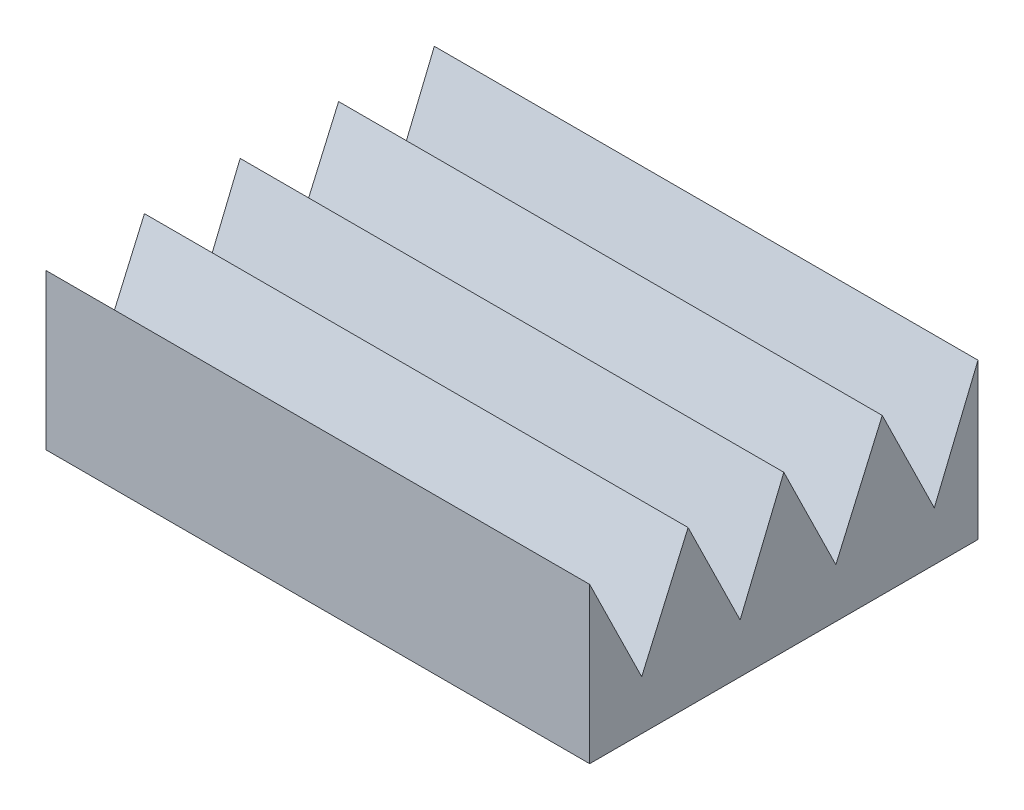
ISO-10303-21;
HEADER;
FILE_DESCRIPTION(('STEP AP214'),'2;1');
FILE_NAME('part.step','',(''),(''),'','','');
FILE_SCHEMA(('AUTOMOTIVE_DESIGN { 1 0 10303 214 1 1 1 1 }'));
ENDSEC;
DATA;
#1=APPLICATION_CONTEXT('core data for automotive mechanical design processes');
#2=APPLICATION_PROTOCOL_DEFINITION('international standard','automotive_design',2000,#1);
#3=PRODUCT_CONTEXT('',#1,'mechanical');
#4=PRODUCT('Part','Part','',(#3));
#5=PRODUCT_RELATED_PRODUCT_CATEGORY('part','',(#4));
#6=PRODUCT_DEFINITION_FORMATION('','',#4);
#7=PRODUCT_DEFINITION_CONTEXT('part definition',#1,'design');
#8=PRODUCT_DEFINITION('design','',#6,#7);
#9=PRODUCT_DEFINITION_SHAPE('','',#8);
#10=(LENGTH_UNIT() NAMED_UNIT(*) SI_UNIT(.MILLI.,.METRE.));
#11=(NAMED_UNIT(*) PLANE_ANGLE_UNIT() SI_UNIT($,.RADIAN.));
#12=(NAMED_UNIT(*) SI_UNIT($,.STERADIAN.) SOLID_ANGLE_UNIT());
#13=UNCERTAINTY_MEASURE_WITH_UNIT(LENGTH_MEASURE(1.E-05),#10,'distance_accuracy_value','');
#14=(GEOMETRIC_REPRESENTATION_CONTEXT(3) GLOBAL_UNCERTAINTY_ASSIGNED_CONTEXT((#13)) GLOBAL_UNIT_ASSIGNED_CONTEXT((#10,
#11,#12)) REPRESENTATION_CONTEXT('',''));
#15=CARTESIAN_POINT('',(0.,0.,0.));
#16=DIRECTION('',(0.,0.,1.));
#17=DIRECTION('',(1.,0.,0.));
#18=AXIS2_PLACEMENT_3D('',#15,#16,#17);
#19=CARTESIAN_POINT('',(0.,20.,0.));
#20=DIRECTION('',(1.,0.,0.));
#21=DIRECTION('',(0.,0.,-1.));
#22=AXIS2_PLACEMENT_3D('',#19,#20,#21);
#23=PLANE('',#22);
#24=DIRECTION('',(0.,0.916108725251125,-0.400929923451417));
#25=VECTOR('',#24,1.);
#26=CARTESIAN_POINT('',(0.,7.74201591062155,17.6901945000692));
#27=LINE('',#26,#25);
#28=CARTESIAN_POINT('',(0.,6.34501926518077,18.3015823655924));
#29=VERTEX_POINT('',#28);
#30=CARTESIAN_POINT('',(0.,20.,12.3255554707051));
#31=VERTEX_POINT('',#30);
#32=EDGE_CURVE('E157',#29,#31,#27,.T.);
#33=ORIENTED_EDGE('',*,*,#32,.T.);
#34=DIRECTION('',(0.,-0.897795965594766,-0.440411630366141));
#35=VECTOR('',#34,1.);
#36=CARTESIAN_POINT('',(0.,-0.994273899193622,2.02686540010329));
#37=LINE('',#36,#35);
#38=CARTESIAN_POINT('',(0.,6.34501926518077,5.6271378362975));
#39=VERTEX_POINT('',#38);
#40=EDGE_CURVE('E139',#31,#39,#37,.T.);
#41=ORIENTED_EDGE('',*,*,#40,.T.);
#42=DIRECTION('',(0.,0.924570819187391,-0.381010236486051));
#43=VECTOR('',#42,1.);
#44=CARTESIAN_POINT('',(0.,2.90337600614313,7.0454189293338));
#45=LINE('',#44,#43);
#46=CARTESIAN_POINT('',(0.,20.,0.));
#47=VERTEX_POINT('',#46);
#48=EDGE_CURVE('E146',#39,#47,#45,.T.);
#49=ORIENTED_EDGE('',*,*,#48,.T.);
#50=DIRECTION('',(0.,-1.,0.));
#51=VECTOR('',#50,1.);
#52=CARTESIAN_POINT('',(0.,20.,0.));
#53=LINE('',#52,#51);
#54=CARTESIAN_POINT('',(0.,0.,0.));
#55=VERTEX_POINT('',#54);
#56=EDGE_CURVE('E211',#47,#55,#53,.T.);
#57=ORIENTED_EDGE('',*,*,#56,.T.);
#58=DIRECTION('',(0.,0.,1.));
#59=VECTOR('',#58,1.);
#60=CARTESIAN_POINT('',(0.,0.,0.));
#61=LINE('',#60,#59);
#62=CARTESIAN_POINT('',(0.,0.,50.));
#63=VERTEX_POINT('',#62);
#64=EDGE_CURVE('E206',#55,#63,#61,.T.);
#65=ORIENTED_EDGE('',*,*,#64,.T.);
#66=DIRECTION('',(0.,-1.,0.));
#67=VECTOR('',#66,1.);
#68=CARTESIAN_POINT('',(0.,20.,50.));
#69=LINE('',#68,#67);
#70=CARTESIAN_POINT('',(0.,20.,50.));
#71=VERTEX_POINT('',#70);
#72=EDGE_CURVE('E12',#71,#63,#69,.T.);
#73=ORIENTED_EDGE('',*,*,#72,.F.);
#74=DIRECTION('',(0.,-0.897795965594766,-0.440411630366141));
#75=VECTOR('',#74,1.);
#76=CARTESIAN_POINT('',(0.,-15.8907411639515,32.3938840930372));
#77=LINE('',#76,#75);
#78=CARTESIAN_POINT('',(0.,6.34501926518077,43.3015823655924));
#79=VERTEX_POINT('',#78);
#80=EDGE_CURVE('E192',#71,#79,#77,.T.);
#81=ORIENTED_EDGE('',*,*,#80,.T.);
#82=DIRECTION('',(0.,0.916108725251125,-0.400929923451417));
#83=VECTOR('',#82,1.);
#84=CARTESIAN_POINT('',(0.,16.9244009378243,38.6715744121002));
#85=LINE('',#84,#83);
#86=CARTESIAN_POINT('',(0.,20.,37.3255554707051));
#87=VERTEX_POINT('',#86);
#88=EDGE_CURVE('E195',#79,#87,#85,.T.);
#89=ORIENTED_EDGE('',*,*,#88,.T.);
#90=DIRECTION('',(0.,-0.897795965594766,-0.440411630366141));
#91=VECTOR('',#90,1.);
#92=CARTESIAN_POINT('',(0.,-10.879268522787,22.1778052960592));
#93=LINE('',#92,#91);
#94=CARTESIAN_POINT('',(0.,6.34501926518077,30.6271378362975));
#95=VERTEX_POINT('',#94);
#96=EDGE_CURVE('E174',#87,#95,#93,.T.);
#97=ORIENTED_EDGE('',*,*,#96,.T.);
#98=DIRECTION('',(0.,0.924570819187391,-0.381010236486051));
#99=VECTOR('',#98,1.);
#100=CARTESIAN_POINT('',(0.,11.7101496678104,28.4161989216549));
#101=LINE('',#100,#99);
#102=CARTESIAN_POINT('',(0.,20.,25.));
#103=VERTEX_POINT('',#102);
#104=EDGE_CURVE('E178',#95,#103,#101,.T.);
#105=ORIENTED_EDGE('',*,*,#104,.T.);
#106=DIRECTION('',(0.,-0.897795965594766,-0.440411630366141));
#107=VECTOR('',#106,1.);
#108=CARTESIAN_POINT('',(0.,-6.00574654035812,12.2429441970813));
#109=LINE('',#108,#107);
#110=EDGE_CURVE('E163',#103,#29,#109,.T.);
#111=ORIENTED_EDGE('',*,*,#110,.T.);
#112=EDGE_LOOP('',(#33,#41,#49,#57,#65,#73,#81,#89,#97,#105,#111));
#113=FACE_BOUND('',#112,.T.);
#114=ADVANCED_FACE('F51',(#113),#23,.F.);
#115=CARTESIAN_POINT('',(0.,20.,50.));
#116=DIRECTION('',(0.,0.,-1.));
#117=DIRECTION('',(-1.,0.,0.));
#118=AXIS2_PLACEMENT_3D('',#115,#116,#117);
#119=PLANE('',#118);
#120=DIRECTION('',(1.,0.,0.));
#121=VECTOR('',#120,1.);
#122=CARTESIAN_POINT('',(0.,0.,50.));
#123=LINE('',#122,#121);
#124=CARTESIAN_POINT('',(70.,0.,50.));
#125=VERTEX_POINT('',#124);
#126=EDGE_CURVE('E214',#63,#125,#123,.T.);
#127=ORIENTED_EDGE('',*,*,#126,.T.);
#128=DIRECTION('',(0.,-1.,0.));
#129=VECTOR('',#128,1.);
#130=CARTESIAN_POINT('',(70.,20.,50.));
#131=LINE('',#130,#129);
#132=CARTESIAN_POINT('',(70.,20.,50.));
#133=VERTEX_POINT('',#132);
#134=EDGE_CURVE('E58',#133,#125,#131,.T.);
#135=ORIENTED_EDGE('',*,*,#134,.F.);
#136=DIRECTION('',(1.,0.,0.));
#137=VECTOR('',#136,1.);
#138=CARTESIAN_POINT('',(0.,20.,50.));
#139=LINE('',#138,#137);
#140=EDGE_CURVE('E208',#71,#133,#139,.T.);
#141=ORIENTED_EDGE('',*,*,#140,.F.);
#142=ORIENTED_EDGE('',*,*,#72,.T.);
#143=EDGE_LOOP('',(#127,#135,#141,#142));
#144=FACE_BOUND('',#143,.T.);
#145=ADVANCED_FACE('F251',(#144),#119,.F.);
#146=CARTESIAN_POINT('',(70.,20.,0.));
#147=DIRECTION('',(-1.,0.,0.));
#148=DIRECTION('',(0.,0.,1.));
#149=AXIS2_PLACEMENT_3D('',#146,#147,#148);
#150=PLANE('',#149);
#151=DIRECTION('',(0.,0.924570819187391,-0.381010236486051));
#152=VECTOR('',#151,1.);
#153=CARTESIAN_POINT('',(70.,2.90337600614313,7.0454189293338));
#154=LINE('',#153,#152);
#155=CARTESIAN_POINT('',(70.,6.34501926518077,5.6271378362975));
#156=VERTEX_POINT('',#155);
#157=CARTESIAN_POINT('',(70.,20.,0.));
#158=VERTEX_POINT('',#157);
#159=EDGE_CURVE('E158',#156,#158,#154,.T.);
#160=ORIENTED_EDGE('',*,*,#159,.F.);
#161=DIRECTION('',(0.,-0.897795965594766,-0.440411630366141));
#162=VECTOR('',#161,1.);
#163=CARTESIAN_POINT('',(70.,-0.994273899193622,2.02686540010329));
#164=LINE('',#163,#162);
#165=CARTESIAN_POINT('',(70.,20.,12.3255554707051));
#166=VERTEX_POINT('',#165);
#167=EDGE_CURVE('E142',#166,#156,#164,.T.);
#168=ORIENTED_EDGE('',*,*,#167,.F.);
#169=DIRECTION('',(0.,0.916108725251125,-0.400929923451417));
#170=VECTOR('',#169,1.);
#171=CARTESIAN_POINT('',(70.,7.74201591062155,17.6901945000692));
#172=LINE('',#171,#170);
#173=CARTESIAN_POINT('',(70.,6.34501926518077,18.3015823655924));
#174=VERTEX_POINT('',#173);
#175=EDGE_CURVE('E165',#174,#166,#172,.T.);
#176=ORIENTED_EDGE('',*,*,#175,.F.);
#177=DIRECTION('',(0.,-0.897795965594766,-0.440411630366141));
#178=VECTOR('',#177,1.);
#179=CARTESIAN_POINT('',(70.,-6.00574654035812,12.2429441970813));
#180=LINE('',#179,#178);
#181=CARTESIAN_POINT('',(70.,20.,25.));
#182=VERTEX_POINT('',#181);
#183=EDGE_CURVE('E145',#182,#174,#180,.T.);
#184=ORIENTED_EDGE('',*,*,#183,.F.);
#185=DIRECTION('',(0.,0.924570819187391,-0.381010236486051));
#186=VECTOR('',#185,1.);
#187=CARTESIAN_POINT('',(70.,11.7101496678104,28.4161989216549));
#188=LINE('',#187,#186);
#189=CARTESIAN_POINT('',(70.,6.34501926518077,30.6271378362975));
#190=VERTEX_POINT('',#189);
#191=EDGE_CURVE('E182',#190,#182,#188,.T.);
#192=ORIENTED_EDGE('',*,*,#191,.F.);
#193=DIRECTION('',(0.,-0.897795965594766,-0.440411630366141));
#194=VECTOR('',#193,1.);
#195=CARTESIAN_POINT('',(70.,-10.879268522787,22.1778052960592));
#196=LINE('',#195,#194);
#197=CARTESIAN_POINT('',(70.,20.,37.3255554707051));
#198=VERTEX_POINT('',#197);
#199=EDGE_CURVE('E181',#198,#190,#196,.T.);
#200=ORIENTED_EDGE('',*,*,#199,.F.);
#201=DIRECTION('',(0.,0.916108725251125,-0.400929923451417));
#202=VECTOR('',#201,1.);
#203=CARTESIAN_POINT('',(70.,16.9244009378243,38.6715744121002));
#204=LINE('',#203,#202);
#205=CARTESIAN_POINT('',(70.,6.34501926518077,43.3015823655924));
#206=VERTEX_POINT('',#205);
#207=EDGE_CURVE('E196',#206,#198,#204,.T.);
#208=ORIENTED_EDGE('',*,*,#207,.F.);
#209=DIRECTION('',(0.,-0.897795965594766,-0.440411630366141));
#210=VECTOR('',#209,1.);
#211=CARTESIAN_POINT('',(70.,-15.8907411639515,32.3938840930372));
#212=LINE('',#211,#210);
#213=EDGE_CURVE('E185',#133,#206,#212,.T.);
#214=ORIENTED_EDGE('',*,*,#213,.F.);
#215=ORIENTED_EDGE('',*,*,#134,.T.);
#216=DIRECTION('',(0.,0.,-1.));
#217=VECTOR('',#216,1.);
#218=CARTESIAN_POINT('',(70.,0.,0.));
#219=LINE('',#218,#217);
#220=CARTESIAN_POINT('',(70.,0.,0.));
#221=VERTEX_POINT('',#220);
#222=EDGE_CURVE('E73',#125,#221,#219,.T.);
#223=ORIENTED_EDGE('',*,*,#222,.T.);
#224=DIRECTION('',(0.,-1.,0.));
#225=VECTOR('',#224,1.);
#226=CARTESIAN_POINT('',(70.,20.,0.));
#227=LINE('',#226,#225);
#228=EDGE_CURVE('E219',#158,#221,#227,.T.);
#229=ORIENTED_EDGE('',*,*,#228,.F.);
#230=EDGE_LOOP('',(#160,#168,#176,#184,#192,#200,#208,#214,#215,#223,#229));
#231=FACE_BOUND('',#230,.T.);
#232=ADVANCED_FACE('F222',(#231),#150,.F.);
#233=CARTESIAN_POINT('',(0.,20.,0.));
#234=DIRECTION('',(0.,0.,1.));
#235=DIRECTION('',(1.,0.,0.));
#236=AXIS2_PLACEMENT_3D('',#233,#234,#235);
#237=PLANE('',#236);
#238=DIRECTION('',(-1.,0.,0.));
#239=VECTOR('',#238,1.);
#240=CARTESIAN_POINT('',(0.,0.,0.));
#241=LINE('',#240,#239);
#242=EDGE_CURVE('E65',#221,#55,#241,.T.);
#243=ORIENTED_EDGE('',*,*,#242,.T.);
#244=ORIENTED_EDGE('',*,*,#56,.F.);
#245=DIRECTION('',(-1.,0.,0.));
#246=VECTOR('',#245,1.);
#247=CARTESIAN_POINT('',(0.,20.,0.));
#248=LINE('',#247,#246);
#249=EDGE_CURVE('E151',#158,#47,#248,.T.);
#250=ORIENTED_EDGE('',*,*,#249,.F.);
#251=ORIENTED_EDGE('',*,*,#228,.T.);
#252=EDGE_LOOP('',(#243,#244,#250,#251));
#253=FACE_BOUND('',#252,.T.);
#254=ADVANCED_FACE('F230',(#253),#237,.F.);
#255=CARTESIAN_POINT('',(0.,0.,0.));
#256=DIRECTION('',(0.,1.,0.));
#257=DIRECTION('',(0.,0.,1.));
#258=AXIS2_PLACEMENT_3D('',#255,#256,#257);
#259=PLANE('',#258);
#260=ORIENTED_EDGE('',*,*,#64,.F.);
#261=ORIENTED_EDGE('',*,*,#242,.F.);
#262=ORIENTED_EDGE('',*,*,#222,.F.);
#263=ORIENTED_EDGE('',*,*,#126,.F.);
#264=EDGE_LOOP('',(#260,#261,#262,#263));
#265=FACE_BOUND('',#264,.T.);
#266=ADVANCED_FACE('F228',(#265),#259,.F.);
#267=CARTESIAN_POINT('',(0.,-15.8907411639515,32.3938840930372));
#268=DIRECTION('',(0.,-0.44041163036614,0.897795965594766));
#269=DIRECTION('',(0.,-0.897795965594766,-0.440411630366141));
#270=AXIS2_PLACEMENT_3D('',#267,#268,#269);
#271=PLANE('',#270);
#272=ORIENTED_EDGE('',*,*,#213,.T.);
#273=DIRECTION('',(1.,0.,0.));
#274=VECTOR('',#273,1.);
#275=CARTESIAN_POINT('',(0.,6.34501926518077,43.3015823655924));
#276=LINE('',#275,#274);
#277=EDGE_CURVE('E199',#79,#206,#276,.T.);
#278=ORIENTED_EDGE('',*,*,#277,.F.);
#279=ORIENTED_EDGE('',*,*,#80,.F.);
#280=ORIENTED_EDGE('',*,*,#140,.T.);
#281=EDGE_LOOP('',(#272,#278,#279,#280));
#282=FACE_BOUND('',#281,.T.);
#283=ADVANCED_FACE('F250',(#282),#271,.F.);
#284=CARTESIAN_POINT('',(0.,16.9244009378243,38.6715744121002));
#285=DIRECTION('',(0.,-0.400929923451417,-0.916108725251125));
#286=DIRECTION('',(0.,0.916108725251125,-0.400929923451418));
#287=AXIS2_PLACEMENT_3D('',#284,#285,#286);
#288=PLANE('',#287);
#289=ORIENTED_EDGE('',*,*,#207,.T.);
#290=DIRECTION('',(1.,0.,0.));
#291=VECTOR('',#290,1.);
#292=CARTESIAN_POINT('',(0.,20.,37.3255554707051));
#293=LINE('',#292,#291);
#294=EDGE_CURVE('E204',#87,#198,#293,.T.);
#295=ORIENTED_EDGE('',*,*,#294,.F.);
#296=ORIENTED_EDGE('',*,*,#88,.F.);
#297=ORIENTED_EDGE('',*,*,#277,.T.);
#298=EDGE_LOOP('',(#289,#295,#296,#297));
#299=FACE_BOUND('',#298,.T.);
#300=ADVANCED_FACE('F247',(#299),#288,.F.);
#301=CARTESIAN_POINT('',(0.,-10.879268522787,22.1778052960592));
#302=DIRECTION('',(0.,-0.44041163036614,0.897795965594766));
#303=DIRECTION('',(0.,-0.897795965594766,-0.440411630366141));
#304=AXIS2_PLACEMENT_3D('',#301,#302,#303);
#305=PLANE('',#304);
#306=ORIENTED_EDGE('',*,*,#199,.T.);
#307=DIRECTION('',(1.,0.,0.));
#308=VECTOR('',#307,1.);
#309=CARTESIAN_POINT('',(0.,6.34501926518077,30.6271378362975));
#310=LINE('',#309,#308);
#311=EDGE_CURVE('E176',#95,#190,#310,.T.);
#312=ORIENTED_EDGE('',*,*,#311,.F.);
#313=ORIENTED_EDGE('',*,*,#96,.F.);
#314=ORIENTED_EDGE('',*,*,#294,.T.);
#315=EDGE_LOOP('',(#306,#312,#313,#314));
#316=FACE_BOUND('',#315,.T.);
#317=ADVANCED_FACE('F244',(#316),#305,.F.);
#318=CARTESIAN_POINT('',(0.,11.7101496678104,28.4161989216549));
#319=DIRECTION('',(0.,-0.381010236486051,-0.924570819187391));
#320=DIRECTION('',(0.,0.924570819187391,-0.381010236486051));
#321=AXIS2_PLACEMENT_3D('',#318,#319,#320);
#322=PLANE('',#321);
#323=ORIENTED_EDGE('',*,*,#191,.T.);
#324=DIRECTION('',(1.,0.,0.));
#325=VECTOR('',#324,1.);
#326=CARTESIAN_POINT('',(0.,20.,25.));
#327=LINE('',#326,#325);
#328=EDGE_CURVE('E179',#103,#182,#327,.T.);
#329=ORIENTED_EDGE('',*,*,#328,.F.);
#330=ORIENTED_EDGE('',*,*,#104,.F.);
#331=ORIENTED_EDGE('',*,*,#311,.T.);
#332=EDGE_LOOP('',(#323,#329,#330,#331));
#333=FACE_BOUND('',#332,.T.);
#334=ADVANCED_FACE('F241',(#333),#322,.F.);
#335=CARTESIAN_POINT('',(0.,-6.00574654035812,12.2429441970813));
#336=DIRECTION('',(0.,-0.44041163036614,0.897795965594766));
#337=DIRECTION('',(0.,-0.897795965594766,-0.440411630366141));
#338=AXIS2_PLACEMENT_3D('',#335,#336,#337);
#339=PLANE('',#338);
#340=ORIENTED_EDGE('',*,*,#183,.T.);
#341=DIRECTION('',(1.,0.,0.));
#342=VECTOR('',#341,1.);
#343=CARTESIAN_POINT('',(0.,6.34501926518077,18.3015823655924));
#344=LINE('',#343,#342);
#345=EDGE_CURVE('E167',#29,#174,#344,.T.);
#346=ORIENTED_EDGE('',*,*,#345,.F.);
#347=ORIENTED_EDGE('',*,*,#110,.F.);
#348=ORIENTED_EDGE('',*,*,#328,.T.);
#349=EDGE_LOOP('',(#340,#346,#347,#348));
#350=FACE_BOUND('',#349,.T.);
#351=ADVANCED_FACE('F236',(#350),#339,.F.);
#352=CARTESIAN_POINT('',(0.,7.74201591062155,17.6901945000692));
#353=DIRECTION('',(0.,-0.400929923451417,-0.916108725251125));
#354=DIRECTION('',(0.,0.916108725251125,-0.400929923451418));
#355=AXIS2_PLACEMENT_3D('',#352,#353,#354);
#356=PLANE('',#355);
#357=ORIENTED_EDGE('',*,*,#175,.T.);
#358=DIRECTION('',(1.,0.,0.));
#359=VECTOR('',#358,1.);
#360=CARTESIAN_POINT('',(0.,20.,12.3255554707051));
#361=LINE('',#360,#359);
#362=EDGE_CURVE('E172',#31,#166,#361,.T.);
#363=ORIENTED_EDGE('',*,*,#362,.F.);
#364=ORIENTED_EDGE('',*,*,#32,.F.);
#365=ORIENTED_EDGE('',*,*,#345,.T.);
#366=EDGE_LOOP('',(#357,#363,#364,#365));
#367=FACE_BOUND('',#366,.T.);
#368=ADVANCED_FACE('F234',(#367),#356,.F.);
#369=CARTESIAN_POINT('',(0.,-0.994273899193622,2.02686540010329));
#370=DIRECTION('',(0.,-0.44041163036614,0.897795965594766));
#371=DIRECTION('',(0.,-0.897795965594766,-0.440411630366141));
#372=AXIS2_PLACEMENT_3D('',#369,#370,#371);
#373=PLANE('',#372);
#374=ORIENTED_EDGE('',*,*,#167,.T.);
#375=DIRECTION('',(1.,0.,0.));
#376=VECTOR('',#375,1.);
#377=CARTESIAN_POINT('',(0.,6.34501926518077,5.6271378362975));
#378=LINE('',#377,#376);
#379=EDGE_CURVE('E135',#39,#156,#378,.T.);
#380=ORIENTED_EDGE('',*,*,#379,.F.);
#381=ORIENTED_EDGE('',*,*,#40,.F.);
#382=ORIENTED_EDGE('',*,*,#362,.T.);
#383=EDGE_LOOP('',(#374,#380,#381,#382));
#384=FACE_BOUND('',#383,.T.);
#385=ADVANCED_FACE('F137',(#384),#373,.F.);
#386=CARTESIAN_POINT('',(0.,2.90337600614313,7.0454189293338));
#387=DIRECTION('',(0.,-0.381010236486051,-0.924570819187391));
#388=DIRECTION('',(0.,0.924570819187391,-0.381010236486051));
#389=AXIS2_PLACEMENT_3D('',#386,#387,#388);
#390=PLANE('',#389);
#391=ORIENTED_EDGE('',*,*,#159,.T.);
#392=ORIENTED_EDGE('',*,*,#249,.T.);
#393=ORIENTED_EDGE('',*,*,#48,.F.);
#394=ORIENTED_EDGE('',*,*,#379,.T.);
#395=EDGE_LOOP('',(#391,#392,#393,#394));
#396=FACE_BOUND('',#395,.T.);
#397=ADVANCED_FACE('F149',(#396),#390,.F.);
#398=CLOSED_SHELL('',(#114,#145,#232,#254,#266,#283,#300,#317,#334,#351,#368,#385,#397));
#399=MANIFOLD_SOLID_BREP('B2',#398);
#400=ADVANCED_BREP_SHAPE_REPRESENTATION('',(#18,#399),#14);
#401=SHAPE_DEFINITION_REPRESENTATION(#9,#400);
ENDSEC;
END-ISO-10303-21;
